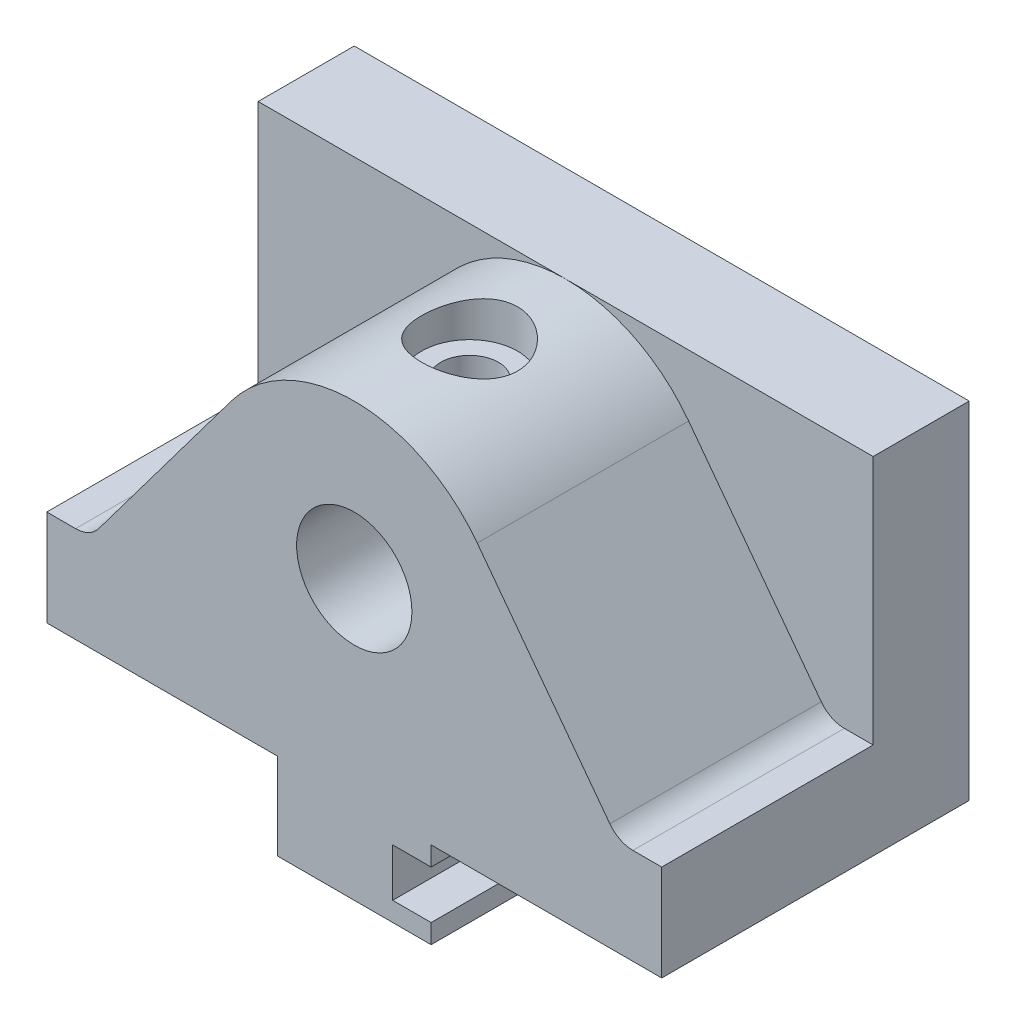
ISO-10303-21;
HEADER;
FILE_DESCRIPTION(('STEP AP214'),'2;1');
FILE_NAME('part.step','',(''),(''),'','','');
FILE_SCHEMA(('AUTOMOTIVE_DESIGN { 1 0 10303 214 1 1 1 1 }'));
ENDSEC;
DATA;
#1=APPLICATION_CONTEXT('core data for automotive mechanical design processes');
#2=APPLICATION_PROTOCOL_DEFINITION('international standard','automotive_design',2000,#1);
#3=PRODUCT_CONTEXT('',#1,'mechanical');
#4=PRODUCT('Part','Part','',(#3));
#5=PRODUCT_RELATED_PRODUCT_CATEGORY('part','',(#4));
#6=PRODUCT_DEFINITION_FORMATION('','',#4);
#7=PRODUCT_DEFINITION_CONTEXT('part definition',#1,'design');
#8=PRODUCT_DEFINITION('design','',#6,#7);
#9=PRODUCT_DEFINITION_SHAPE('','',#8);
#10=(LENGTH_UNIT() NAMED_UNIT(*) SI_UNIT(.MILLI.,.METRE.));
#11=(NAMED_UNIT(*) PLANE_ANGLE_UNIT() SI_UNIT($,.RADIAN.));
#12=(NAMED_UNIT(*) SI_UNIT($,.STERADIAN.) SOLID_ANGLE_UNIT());
#13=UNCERTAINTY_MEASURE_WITH_UNIT(LENGTH_MEASURE(1.E-05),#10,'distance_accuracy_value','');
#14=(GEOMETRIC_REPRESENTATION_CONTEXT(3) GLOBAL_UNCERTAINTY_ASSIGNED_CONTEXT((#13)) GLOBAL_UNIT_ASSIGNED_CONTEXT((#10,
#11,#12)) REPRESENTATION_CONTEXT('',''));
#15=CARTESIAN_POINT('',(0.,0.,0.));
#16=DIRECTION('',(0.,0.,1.));
#17=DIRECTION('',(1.,0.,0.));
#18=AXIS2_PLACEMENT_3D('',#15,#16,#17);
#19=CARTESIAN_POINT('',(8.,-9.,22.));
#20=DIRECTION('',(-1.,0.,0.));
#21=DIRECTION('',(0.,-1.,0.));
#22=AXIS2_PLACEMENT_3D('',#19,#20,#21);
#23=PLANE('',#22);
#24=DIRECTION('',(0.,-1.,0.));
#25=VECTOR('',#24,1.);
#26=CARTESIAN_POINT('',(8.,0.,-10.));
#27=LINE('',#26,#25);
#28=CARTESIAN_POINT('',(8.,-6.99999999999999,-10.));
#29=VERTEX_POINT('',#28);
#30=CARTESIAN_POINT('',(8.,-9.,-10.));
#31=VERTEX_POINT('',#30);
#32=EDGE_CURVE('E208',#29,#31,#27,.T.);
#33=ORIENTED_EDGE('',*,*,#32,.F.);
#34=DIRECTION('',(0.,0.,1.));
#35=VECTOR('',#34,1.);
#36=CARTESIAN_POINT('',(8.,-6.99999999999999,-10.));
#37=LINE('',#36,#35);
#38=CARTESIAN_POINT('',(8.,-6.99999999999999,22.));
#39=VERTEX_POINT('',#38);
#40=EDGE_CURVE('E402',#29,#39,#37,.T.);
#41=ORIENTED_EDGE('',*,*,#40,.T.);
#42=DIRECTION('',(0.,1.,0.));
#43=VECTOR('',#42,1.);
#44=CARTESIAN_POINT('',(8.,-9.,22.));
#45=LINE('',#44,#43);
#46=CARTESIAN_POINT('',(8.,-9.,22.));
#47=VERTEX_POINT('',#46);
#48=EDGE_CURVE('E266',#47,#39,#45,.T.);
#49=ORIENTED_EDGE('',*,*,#48,.F.);
#50=DIRECTION('',(0.,0.,-1.));
#51=VECTOR('',#50,1.);
#52=CARTESIAN_POINT('',(8.,-9.,22.));
#53=LINE('',#52,#51);
#54=EDGE_CURVE('E395',#47,#31,#53,.T.);
#55=ORIENTED_EDGE('',*,*,#54,.T.);
#56=EDGE_LOOP('',(#33,#41,#49,#55));
#57=FACE_BOUND('',#56,.T.);
#58=ADVANCED_FACE('F31',(#57),#23,.F.);
#59=CARTESIAN_POINT('',(8.,0.,22.));
#60=DIRECTION('',(0.,1.,0.));
#61=DIRECTION('',(-1.,0.,0.));
#62=AXIS2_PLACEMENT_3D('',#59,#60,#61);
#63=PLANE('',#62);
#64=DIRECTION('',(0.,0.,-1.));
#65=VECTOR('',#64,1.);
#66=CARTESIAN_POINT('',(8.,0.,22.));
#67=LINE('',#66,#65);
#68=CARTESIAN_POINT('',(8.,0.,22.));
#69=VERTEX_POINT('',#68);
#70=CARTESIAN_POINT('',(8.,0.,-10.));
#71=VERTEX_POINT('',#70);
#72=EDGE_CURVE('E269',#69,#71,#67,.T.);
#73=ORIENTED_EDGE('',*,*,#72,.T.);
#74=DIRECTION('',(-1.,0.,0.));
#75=VECTOR('',#74,1.);
#76=CARTESIAN_POINT('',(32.,0.,-10.));
#77=LINE('',#76,#75);
#78=CARTESIAN_POINT('',(32.,0.,-10.));
#79=VERTEX_POINT('',#78);
#80=EDGE_CURVE('E206',#79,#71,#77,.T.);
#81=ORIENTED_EDGE('',*,*,#80,.F.);
#82=DIRECTION('',(0.,0.,-1.));
#83=VECTOR('',#82,1.);
#84=CARTESIAN_POINT('',(32.,0.,22.));
#85=LINE('',#84,#83);
#86=CARTESIAN_POINT('',(32.,0.,22.));
#87=VERTEX_POINT('',#86);
#88=EDGE_CURVE('E292',#87,#79,#85,.T.);
#89=ORIENTED_EDGE('',*,*,#88,.F.);
#90=DIRECTION('',(1.,0.,0.));
#91=VECTOR('',#90,1.);
#92=CARTESIAN_POINT('',(8.,0.,22.));
#93=LINE('',#92,#91);
#94=EDGE_CURVE('E241',#69,#87,#93,.T.);
#95=ORIENTED_EDGE('',*,*,#94,.F.);
#96=EDGE_LOOP('',(#73,#81,#89,#95));
#97=FACE_BOUND('',#96,.T.);
#98=ADVANCED_FACE('F485',(#97),#63,.F.);
#99=CARTESIAN_POINT('',(32.,0.,22.));
#100=DIRECTION('',(-1.,0.,0.));
#101=DIRECTION('',(0.,0.,1.));
#102=AXIS2_PLACEMENT_3D('',#99,#100,#101);
#103=PLANE('',#102);
#104=ORIENTED_EDGE('',*,*,#88,.T.);
#105=DIRECTION('',(0.,-1.,0.));
#106=VECTOR('',#105,1.);
#107=CARTESIAN_POINT('',(32.,0.,-10.));
#108=LINE('',#107,#106);
#109=CARTESIAN_POINT('',(32.,36.,-10.));
#110=VERTEX_POINT('',#109);
#111=EDGE_CURVE('E383',#110,#79,#108,.T.);
#112=ORIENTED_EDGE('',*,*,#111,.F.);
#113=DIRECTION('',(0.,0.,1.));
#114=VECTOR('',#113,1.);
#115=CARTESIAN_POINT('',(32.,36.,-10.));
#116=LINE('',#115,#114);
#117=CARTESIAN_POINT('',(32.,36.,0.));
#118=VERTEX_POINT('',#117);
#119=EDGE_CURVE('E225',#110,#118,#116,.T.);
#120=ORIENTED_EDGE('',*,*,#119,.T.);
#121=DIRECTION('',(0.,-1.,0.));
#122=VECTOR('',#121,1.);
#123=CARTESIAN_POINT('',(32.,0.,0.));
#124=LINE('',#123,#122);
#125=CARTESIAN_POINT('',(32.,10.,0.));
#126=VERTEX_POINT('',#125);
#127=EDGE_CURVE('E231',#118,#126,#124,.T.);
#128=ORIENTED_EDGE('',*,*,#127,.T.);
#129=DIRECTION('',(0.,0.,-1.));
#130=VECTOR('',#129,1.);
#131=CARTESIAN_POINT('',(32.,10.,22.));
#132=LINE('',#131,#130);
#133=CARTESIAN_POINT('',(32.,10.,22.));
#134=VERTEX_POINT('',#133);
#135=EDGE_CURVE('E325',#134,#126,#132,.T.);
#136=ORIENTED_EDGE('',*,*,#135,.F.);
#137=DIRECTION('',(0.,1.,0.));
#138=VECTOR('',#137,1.);
#139=CARTESIAN_POINT('',(32.,0.,22.));
#140=LINE('',#139,#138);
#141=EDGE_CURVE('E244',#87,#134,#140,.T.);
#142=ORIENTED_EDGE('',*,*,#141,.F.);
#143=EDGE_LOOP('',(#104,#112,#120,#128,#136,#142));
#144=FACE_BOUND('',#143,.T.);
#145=ADVANCED_FACE('F490',(#144),#103,.F.);
#146=CARTESIAN_POINT('',(32.,10.,22.));
#147=DIRECTION('',(0.,-1.,0.));
#148=DIRECTION('',(1.,0.,0.));
#149=AXIS2_PLACEMENT_3D('',#146,#147,#148);
#150=PLANE('',#149);
#151=DIRECTION('',(-1.,0.,0.));
#152=VECTOR('',#151,1.);
#153=CARTESIAN_POINT('',(32.,10.,0.));
#154=LINE('',#153,#152);
#155=CARTESIAN_POINT('',(29.,10.,0.));
#156=VERTEX_POINT('',#155);
#157=EDGE_CURVE('E273',#126,#156,#154,.T.);
#158=ORIENTED_EDGE('',*,*,#157,.T.);
#159=DIRECTION('',(0.,0.,-1.));
#160=VECTOR('',#159,1.);
#161=CARTESIAN_POINT('',(29.,10.,22.));
#162=LINE('',#161,#160);
#163=CARTESIAN_POINT('',(29.,10.,22.));
#164=VERTEX_POINT('',#163);
#165=EDGE_CURVE('E58',#156,#164,#162,.F.);
#166=ORIENTED_EDGE('',*,*,#165,.T.);
#167=DIRECTION('',(-1.,0.,0.));
#168=VECTOR('',#167,1.);
#169=CARTESIAN_POINT('',(32.,10.,22.));
#170=LINE('',#169,#168);
#171=EDGE_CURVE('E247',#134,#164,#170,.T.);
#172=ORIENTED_EDGE('',*,*,#171,.F.);
#173=ORIENTED_EDGE('',*,*,#135,.T.);
#174=EDGE_LOOP('',(#158,#166,#172,#173));
#175=FACE_BOUND('',#174,.T.);
#176=ADVANCED_FACE('F323',(#175),#150,.F.);
#177=CARTESIAN_POINT('',(27.5,10.,22.));
#178=DIRECTION('',(-0.8,-0.6,0.));
#179=DIRECTION('',(0.6,-0.8,0.));
#180=AXIS2_PLACEMENT_3D('',#177,#178,#179);
#181=PLANE('',#180);
#182=DIRECTION('',(-0.6,0.8,0.));
#183=VECTOR('',#182,1.);
#184=CARTESIAN_POINT('',(27.5,10.,22.));
#185=LINE('',#184,#183);
#186=CARTESIAN_POINT('',(26.6,11.2,22.));
#187=VERTEX_POINT('',#186);
#188=CARTESIAN_POINT('',(12.8,29.6,22.));
#189=VERTEX_POINT('',#188);
#190=EDGE_CURVE('E249',#187,#189,#185,.T.);
#191=ORIENTED_EDGE('',*,*,#190,.F.);
#192=DIRECTION('',(0.,0.,-1.));
#193=VECTOR('',#192,1.);
#194=CARTESIAN_POINT('',(26.6,11.2,0.));
#195=LINE('',#194,#193);
#196=CARTESIAN_POINT('',(26.6,11.2,0.));
#197=VERTEX_POINT('',#196);
#198=EDGE_CURVE('E296',#187,#197,#195,.T.);
#199=ORIENTED_EDGE('',*,*,#198,.T.);
#200=DIRECTION('',(-0.6,0.8,0.));
#201=VECTOR('',#200,1.);
#202=CARTESIAN_POINT('',(27.5,10.,0.));
#203=LINE('',#202,#201);
#204=CARTESIAN_POINT('',(12.8,29.6,0.));
#205=VERTEX_POINT('',#204);
#206=EDGE_CURVE('E270',#197,#205,#203,.T.);
#207=ORIENTED_EDGE('',*,*,#206,.T.);
#208=DIRECTION('',(0.,0.,-1.));
#209=VECTOR('',#208,1.);
#210=CARTESIAN_POINT('',(12.8,29.6,22.));
#211=LINE('',#210,#209);
#212=EDGE_CURVE('E316',#189,#205,#211,.T.);
#213=ORIENTED_EDGE('',*,*,#212,.F.);
#214=EDGE_LOOP('',(#191,#199,#207,#213));
#215=FACE_BOUND('',#214,.T.);
#216=ADVANCED_FACE('F313',(#215),#181,.F.);
#217=CARTESIAN_POINT('',(0.,20.,22.));
#218=DIRECTION('',(0.,0.,-1.));
#219=DIRECTION('',(-1.,0.,0.));
#220=AXIS2_PLACEMENT_3D('',#217,#218,#219);
#221=CYLINDRICAL_SURFACE('',#220,16.);
#222=CARTESIAN_POINT('',(0.,36.,15.));
#223=CARTESIAN_POINT('',(-0.273756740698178,35.9999986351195,14.9999982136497));
#224=CARTESIAN_POINT('',(-0.547532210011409,35.9929077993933,14.9774430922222));
#225=CARTESIAN_POINT('',(-1.08707683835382,35.9653157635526,14.888055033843));
#226=CARTESIAN_POINT('',(-1.35284417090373,35.9448115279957,14.8212120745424));
#227=CARTESIAN_POINT('',(-1.86851417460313,35.892632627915,14.6457225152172));
#228=CARTESIAN_POINT('',(-2.11844070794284,35.860975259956,14.5371406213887));
#229=CARTESIAN_POINT('',(-2.59653920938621,35.7897587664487,14.2815307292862));
#230=CARTESIAN_POINT('',(-2.82470774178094,35.7501983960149,14.1344966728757));
#231=CARTESIAN_POINT('',(-3.25986133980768,35.6660085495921,13.8013760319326));
#232=CARTESIAN_POINT('',(-3.46608011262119,35.621268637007,13.6143164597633));
#233=CARTESIAN_POINT('',(-3.84478952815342,35.5324018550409,13.2085264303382));
#234=CARTESIAN_POINT('',(-4.01727389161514,35.4882751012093,12.9897900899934));
#235=CARTESIAN_POINT('',(-4.32777345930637,35.4044457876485,12.5202217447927));
#236=CARTESIAN_POINT('',(-4.4648313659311,35.3648795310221,12.2687300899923));
#237=CARTESIAN_POINT('',(-4.69438964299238,35.2963120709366,11.7448307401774));
#238=CARTESIAN_POINT('',(-4.78690175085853,35.2673080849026,11.4724285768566));
#239=CARTESIAN_POINT('',(-4.92193839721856,35.224304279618,10.9230876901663));
#240=CARTESIAN_POINT('',(-4.96588440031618,35.2098789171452,10.6465326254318));
#241=CARTESIAN_POINT('',(-5.00698220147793,35.1964022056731,10.0896275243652));
#242=CARTESIAN_POINT('',(-5.00414643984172,35.1973467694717,9.80927851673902));
#243=CARTESIAN_POINT('',(-4.95287298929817,35.2141275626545,9.26450215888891));
#244=CARTESIAN_POINT('',(-4.90624231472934,35.229373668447,8.99988349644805));
#245=CARTESIAN_POINT('',(-4.77163253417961,35.272081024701,8.48243137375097));
#246=CARTESIAN_POINT('',(-4.68364903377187,35.2995435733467,8.2295991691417));
#247=CARTESIAN_POINT('',(-4.46755498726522,35.3640417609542,7.73859222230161));
#248=CARTESIAN_POINT('',(-4.33887702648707,35.4012113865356,7.5006855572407));
#249=CARTESIAN_POINT('',(-4.04544082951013,35.4808742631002,7.04924892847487));
#250=CARTESIAN_POINT('',(-3.88067322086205,35.523368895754,6.83572531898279));
#251=CARTESIAN_POINT('',(-3.51086781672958,35.6112611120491,6.42890022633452));
#252=CARTESIAN_POINT('',(-3.30433828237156,35.6567027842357,6.23696176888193));
#253=CARTESIAN_POINT('',(-2.86145763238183,35.7436628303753,5.89011242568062));
#254=CARTESIAN_POINT('',(-2.625104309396,35.7851809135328,5.73520428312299));
#255=CARTESIAN_POINT('',(-2.1266584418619,35.8600517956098,5.46588924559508));
#256=CARTESIAN_POINT('',(-1.86437962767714,35.8933384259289,5.35180745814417));
#257=CARTESIAN_POINT('',(-1.32307191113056,35.9475182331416,5.16978799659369));
#258=CARTESIAN_POINT('',(-1.04404812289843,35.9684151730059,5.10183631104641));
#259=CARTESIAN_POINT('',(-0.488740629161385,35.9948555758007,5.01632782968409));
#260=CARTESIAN_POINT('',(-0.212767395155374,36.0009609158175,4.9969258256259));
#261=CARTESIAN_POINT('',(0.338521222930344,35.9987919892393,5.00386490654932));
#262=CARTESIAN_POINT('',(0.613836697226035,35.9905198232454,5.03019930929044));
#263=CARTESIAN_POINT('',(1.1488773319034,35.9608945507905,5.12638237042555));
#264=CARTESIAN_POINT('',(1.40881991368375,35.9398717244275,5.19513307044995));
#265=CARTESIAN_POINT('',(1.91340771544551,35.8872048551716,5.37285740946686));
#266=CARTESIAN_POINT('',(2.15805104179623,35.8555595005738,5.48183601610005));
#267=CARTESIAN_POINT('',(2.63172962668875,35.783941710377,5.73989286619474));
#268=CARTESIAN_POINT('',(2.86023895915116,35.7437850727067,5.88988394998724));
#269=CARTESIAN_POINT('',(3.28946340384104,35.6597364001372,6.2246128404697));
#270=CARTESIAN_POINT('',(3.4901709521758,35.6158433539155,6.40936007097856));
#271=CARTESIAN_POINT('',(3.86634985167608,35.5270797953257,6.81703556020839));
#272=CARTESIAN_POINT('',(4.04050609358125,35.4822394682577,7.04118665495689));
#273=CARTESIAN_POINT('',(4.34885000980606,35.3984778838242,7.5165064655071));
#274=CARTESIAN_POINT('',(4.48303831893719,35.3595565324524,7.76767475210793));
#275=CARTESIAN_POINT('',(4.70680333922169,35.2924712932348,8.28938069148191));
#276=CARTESIAN_POINT('',(4.7965527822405,35.264265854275,8.55983859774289));
#277=CARTESIAN_POINT('',(4.92891577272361,35.2220468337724,9.11308997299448));
#278=CARTESIAN_POINT('',(4.97154725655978,35.2080278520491,9.39587870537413));
#279=CARTESIAN_POINT('',(5.00717624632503,35.1963317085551,9.95201635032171));
#280=CARTESIAN_POINT('',(5.00233118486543,35.1979441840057,10.2252138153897));
#281=CARTESIAN_POINT('',(4.94835272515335,35.2156036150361,10.7666983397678));
#282=CARTESIAN_POINT('',(4.89922139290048,35.2316498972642,11.0349856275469));
#283=CARTESIAN_POINT('',(4.7595091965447,35.2758725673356,11.5551761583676));
#284=CARTESIAN_POINT('',(4.66954569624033,35.3038679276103,11.8072617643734));
#285=CARTESIAN_POINT('',(4.45120909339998,35.3687881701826,12.292961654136));
#286=CARTESIAN_POINT('',(4.32282817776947,35.4057148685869,12.5265721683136));
#287=CARTESIAN_POINT('',(4.02542700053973,35.4861394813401,12.9785838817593));
#288=CARTESIAN_POINT('',(3.85501334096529,35.5298379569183,13.196032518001));
#289=CARTESIAN_POINT('',(3.48083598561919,35.6179599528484,13.599945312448));
#290=CARTESIAN_POINT('',(3.27706336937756,35.6623836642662,13.7864011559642));
#291=CARTESIAN_POINT('',(2.83394665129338,35.748690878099,14.1291301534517));
#292=CARTESIAN_POINT('',(2.59365829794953,35.7904440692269,14.2842189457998));
#293=CARTESIAN_POINT('',(2.0891165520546,35.8650707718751,14.5515956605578));
#294=CARTESIAN_POINT('',(1.82487263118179,35.8979477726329,14.6639004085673));
#295=CARTESIAN_POINT('',(1.30299054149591,35.9488260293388,14.8343654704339));
#296=CARTESIAN_POINT('',(1.04668134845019,35.9678496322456,14.8962994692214));
#297=CARTESIAN_POINT('',(0.526919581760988,35.9934360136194,14.9791134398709));
#298=CARTESIAN_POINT('',(0.263468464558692,36.0000013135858,15.000001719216));
#299=CARTESIAN_POINT('',(0.,36.,15.));
#300=B_SPLINE_CURVE_WITH_KNOTS('',3,(#222,#223,#224,#225,#226,#227,#228,#229,#230,#231,#232,
#233,#234,#235,#236,#237,#238,#239,#240,#241,#242,#243,#244,#245,#246,#247,#248,#249,#250,#251,
#252,#253,#254,#255,#256,#257,#258,#259,#260,#261,#262,#263,#264,#265,#266,#267,#268,#269,#270,
#271,#272,#273,#274,#275,#276,#277,#278,#279,#280,#281,#282,#283,#284,#285,#286,#287,#288,#289,
#290,#291,#292,#293,#294,#295,#296,#297,#298,#299),.UNSPECIFIED.,.T.,.F.,(4,2,2,2,2,2,2,2,2,2,2,
2,2,2,2,2,2,2,2,2,2,2,2,2,2,2,2,2,2,2,2,2,2,2,2,2,2,2,4),(0.,0.820301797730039,1.64078929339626,
2.46000991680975,3.27935968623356,4.12151288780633,4.96382269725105,5.82695084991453,
6.68985145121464,7.52676600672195,8.36345801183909,9.16707669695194,9.97078079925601,
10.7862257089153,11.6018826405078,12.4546698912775,13.3075202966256,14.1670184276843,
15.0262553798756,15.852302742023,16.678229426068,17.4836250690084,18.2891202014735,
19.1142529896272,19.9396098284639,20.7976711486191,21.655718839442,22.5104046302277,
23.3647649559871,24.1804881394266,24.9961732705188,25.7999165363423,26.6038233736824,
27.4391805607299,28.274761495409,29.1376267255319,30.0001522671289,30.789785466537,
31.5792588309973),.UNSPECIFIED.);
#301=CARTESIAN_POINT('',(0.,36.,15.));
#302=VERTEX_POINT('',#301);
#303=EDGE_CURVE('E11',#302,#302,#300,.T.);
#304=ORIENTED_EDGE('',*,*,#303,.T.);
#305=EDGE_LOOP('',(#304));
#306=FACE_BOUND('',#305,.T.);
#307=CARTESIAN_POINT('',(0.,20.,0.));
#308=DIRECTION('',(0.,0.,1.));
#309=DIRECTION('',(1.,0.,0.));
#310=AXIS2_PLACEMENT_3D('',#307,#308,#309);
#311=CIRCLE('',#310,16.);
#312=CARTESIAN_POINT('',(0.,36.,0.));
#313=VERTEX_POINT('',#312);
#314=EDGE_CURVE('E274',#205,#313,#311,.T.);
#315=ORIENTED_EDGE('',*,*,#314,.T.);
#316=CARTESIAN_POINT('',(-12.8,29.6,0.));
#317=VERTEX_POINT('',#316);
#318=EDGE_CURVE('E272',#313,#317,#311,.T.);
#319=ORIENTED_EDGE('',*,*,#318,.T.);
#320=DIRECTION('',(0.,0.,-1.));
#321=VECTOR('',#320,1.);
#322=CARTESIAN_POINT('',(-12.8,29.6,22.));
#323=LINE('',#322,#321);
#324=CARTESIAN_POINT('',(-12.8,29.6,22.));
#325=VERTEX_POINT('',#324);
#326=EDGE_CURVE('E337',#325,#317,#323,.T.);
#327=ORIENTED_EDGE('',*,*,#326,.F.);
#328=CARTESIAN_POINT('',(0.,20.,22.));
#329=DIRECTION('',(0.,0.,1.));
#330=DIRECTION('',(1.,0.,0.));
#331=AXIS2_PLACEMENT_3D('',#328,#329,#330);
#332=CIRCLE('',#331,16.);
#333=EDGE_CURVE('E251',#189,#325,#332,.T.);
#334=ORIENTED_EDGE('',*,*,#333,.F.);
#335=ORIENTED_EDGE('',*,*,#212,.T.);
#336=EDGE_LOOP('',(#315,#319,#327,#334,#335));
#337=FACE_BOUND('',#336,.T.);
#338=ADVANCED_FACE('F354',(#306,#337),#221,.T.);
#339=CARTESIAN_POINT('',(-12.8,29.6,22.));
#340=DIRECTION('',(0.799999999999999,-0.600000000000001,0.));
#341=DIRECTION('',(0.600000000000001,0.799999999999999,0.));
#342=AXIS2_PLACEMENT_3D('',#339,#340,#341);
#343=PLANE('',#342);
#344=DIRECTION('',(-0.600000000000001,-0.799999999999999,0.));
#345=VECTOR('',#344,1.);
#346=CARTESIAN_POINT('',(-12.8,29.6,0.));
#347=LINE('',#346,#345);
#348=CARTESIAN_POINT('',(-26.6,11.2,0.));
#349=VERTEX_POINT('',#348);
#350=EDGE_CURVE('E277',#317,#349,#347,.T.);
#351=ORIENTED_EDGE('',*,*,#350,.T.);
#352=DIRECTION('',(0.,0.,-1.));
#353=VECTOR('',#352,1.);
#354=CARTESIAN_POINT('',(-26.6,11.2,22.));
#355=LINE('',#354,#353);
#356=CARTESIAN_POINT('',(-26.6,11.2,22.));
#357=VERTEX_POINT('',#356);
#358=EDGE_CURVE('E294',#349,#357,#355,.F.);
#359=ORIENTED_EDGE('',*,*,#358,.T.);
#360=DIRECTION('',(-0.600000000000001,-0.799999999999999,0.));
#361=VECTOR('',#360,1.);
#362=CARTESIAN_POINT('',(-12.8,29.6,22.));
#363=LINE('',#362,#361);
#364=EDGE_CURVE('E253',#325,#357,#363,.T.);
#365=ORIENTED_EDGE('',*,*,#364,.F.);
#366=ORIENTED_EDGE('',*,*,#326,.T.);
#367=EDGE_LOOP('',(#351,#359,#365,#366));
#368=FACE_BOUND('',#367,.T.);
#369=ADVANCED_FACE('F514',(#368),#343,.F.);
#370=CARTESIAN_POINT('',(-27.5,10.,22.));
#371=DIRECTION('',(0.,-1.,0.));
#372=DIRECTION('',(0.,0.,-1.));
#373=AXIS2_PLACEMENT_3D('',#370,#371,#372);
#374=PLANE('',#373);
#375=DIRECTION('',(-1.,0.,0.));
#376=VECTOR('',#375,1.);
#377=CARTESIAN_POINT('',(-27.5,10.,22.));
#378=LINE('',#377,#376);
#379=CARTESIAN_POINT('',(-29.,10.,22.));
#380=VERTEX_POINT('',#379);
#381=CARTESIAN_POINT('',(-32.,10.,22.));
#382=VERTEX_POINT('',#381);
#383=EDGE_CURVE('E256',#380,#382,#378,.T.);
#384=ORIENTED_EDGE('',*,*,#383,.F.);
#385=DIRECTION('',(0.,0.,-1.));
#386=VECTOR('',#385,1.);
#387=CARTESIAN_POINT('',(-29.,10.,0.));
#388=LINE('',#387,#386);
#389=CARTESIAN_POINT('',(-29.,10.,0.));
#390=VERTEX_POINT('',#389);
#391=EDGE_CURVE('E288',#380,#390,#388,.T.);
#392=ORIENTED_EDGE('',*,*,#391,.T.);
#393=DIRECTION('',(-1.,0.,0.));
#394=VECTOR('',#393,1.);
#395=CARTESIAN_POINT('',(-27.5,10.,0.));
#396=LINE('',#395,#394);
#397=CARTESIAN_POINT('',(-32.,10.,0.));
#398=VERTEX_POINT('',#397);
#399=EDGE_CURVE('E245',#390,#398,#396,.T.);
#400=ORIENTED_EDGE('',*,*,#399,.T.);
#401=DIRECTION('',(0.,0.,-1.));
#402=VECTOR('',#401,1.);
#403=CARTESIAN_POINT('',(-32.,10.,22.));
#404=LINE('',#403,#402);
#405=EDGE_CURVE('E335',#382,#398,#404,.T.);
#406=ORIENTED_EDGE('',*,*,#405,.F.);
#407=EDGE_LOOP('',(#384,#392,#400,#406));
#408=FACE_BOUND('',#407,.T.);
#409=ADVANCED_FACE('F367',(#408),#374,.F.);
#410=CARTESIAN_POINT('',(-32.,10.,22.));
#411=DIRECTION('',(1.,0.,0.));
#412=DIRECTION('',(0.,1.,0.));
#413=AXIS2_PLACEMENT_3D('',#410,#411,#412);
#414=PLANE('',#413);
#415=ORIENTED_EDGE('',*,*,#405,.T.);
#416=DIRECTION('',(0.,1.,0.));
#417=VECTOR('',#416,1.);
#418=CARTESIAN_POINT('',(-32.,0.,0.));
#419=LINE('',#418,#417);
#420=CARTESIAN_POINT('',(-32.,36.,0.));
#421=VERTEX_POINT('',#420);
#422=EDGE_CURVE('E235',#398,#421,#419,.T.);
#423=ORIENTED_EDGE('',*,*,#422,.T.);
#424=DIRECTION('',(0.,0.,1.));
#425=VECTOR('',#424,1.);
#426=CARTESIAN_POINT('',(-32.,36.,-10.));
#427=LINE('',#426,#425);
#428=CARTESIAN_POINT('',(-32.,36.,-10.));
#429=VERTEX_POINT('',#428);
#430=EDGE_CURVE('E237',#429,#421,#427,.T.);
#431=ORIENTED_EDGE('',*,*,#430,.F.);
#432=DIRECTION('',(0.,1.,0.));
#433=VECTOR('',#432,1.);
#434=CARTESIAN_POINT('',(-32.,0.,-10.));
#435=LINE('',#434,#433);
#436=CARTESIAN_POINT('',(-32.,0.,-10.));
#437=VERTEX_POINT('',#436);
#438=EDGE_CURVE('E221',#437,#429,#435,.T.);
#439=ORIENTED_EDGE('',*,*,#438,.F.);
#440=DIRECTION('',(0.,0.,-1.));
#441=VECTOR('',#440,1.);
#442=CARTESIAN_POINT('',(-32.,0.,22.));
#443=LINE('',#442,#441);
#444=CARTESIAN_POINT('',(-32.,0.,22.));
#445=VERTEX_POINT('',#444);
#446=EDGE_CURVE('E338',#445,#437,#443,.T.);
#447=ORIENTED_EDGE('',*,*,#446,.F.);
#448=DIRECTION('',(0.,-1.,0.));
#449=VECTOR('',#448,1.);
#450=CARTESIAN_POINT('',(-32.,10.,22.));
#451=LINE('',#450,#449);
#452=EDGE_CURVE('E258',#382,#445,#451,.T.);
#453=ORIENTED_EDGE('',*,*,#452,.F.);
#454=EDGE_LOOP('',(#415,#423,#431,#439,#447,#453));
#455=FACE_BOUND('',#454,.T.);
#456=ADVANCED_FACE('F375',(#455),#414,.F.);
#457=CARTESIAN_POINT('',(-32.,0.,22.));
#458=DIRECTION('',(0.,1.,0.));
#459=DIRECTION('',(-1.,0.,0.));
#460=AXIS2_PLACEMENT_3D('',#457,#458,#459);
#461=PLANE('',#460);
#462=ORIENTED_EDGE('',*,*,#446,.T.);
#463=DIRECTION('',(-1.,0.,0.));
#464=VECTOR('',#463,1.);
#465=CARTESIAN_POINT('',(-8.,0.,-10.));
#466=LINE('',#465,#464);
#467=CARTESIAN_POINT('',(-8.,0.,-10.));
#468=VERTEX_POINT('',#467);
#469=EDGE_CURVE('E218',#468,#437,#466,.T.);
#470=ORIENTED_EDGE('',*,*,#469,.F.);
#471=DIRECTION('',(0.,0.,-1.));
#472=VECTOR('',#471,1.);
#473=CARTESIAN_POINT('',(-8.,0.,22.));
#474=LINE('',#473,#472);
#475=CARTESIAN_POINT('',(-8.,0.,22.));
#476=VERTEX_POINT('',#475);
#477=EDGE_CURVE('E344',#476,#468,#474,.T.);
#478=ORIENTED_EDGE('',*,*,#477,.F.);
#479=DIRECTION('',(1.,0.,0.));
#480=VECTOR('',#479,1.);
#481=CARTESIAN_POINT('',(-32.,0.,22.));
#482=LINE('',#481,#480);
#483=EDGE_CURVE('E260',#445,#476,#482,.T.);
#484=ORIENTED_EDGE('',*,*,#483,.F.);
#485=EDGE_LOOP('',(#462,#470,#478,#484));
#486=FACE_BOUND('',#485,.T.);
#487=ADVANCED_FACE('F385',(#486),#461,.F.);
#488=CARTESIAN_POINT('',(-8.,0.,22.));
#489=DIRECTION('',(1.,0.,0.));
#490=DIRECTION('',(0.,1.,0.));
#491=AXIS2_PLACEMENT_3D('',#488,#489,#490);
#492=PLANE('',#491);
#493=ORIENTED_EDGE('',*,*,#477,.T.);
#494=DIRECTION('',(0.,1.,0.));
#495=VECTOR('',#494,1.);
#496=CARTESIAN_POINT('',(-8.,-9.00000000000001,-10.));
#497=LINE('',#496,#495);
#498=CARTESIAN_POINT('',(-8.,-9.00000000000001,-10.));
#499=VERTEX_POINT('',#498);
#500=EDGE_CURVE('E211',#499,#468,#497,.T.);
#501=ORIENTED_EDGE('',*,*,#500,.F.);
#502=DIRECTION('',(0.,0.,-1.));
#503=VECTOR('',#502,1.);
#504=CARTESIAN_POINT('',(-8.,-9.00000000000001,22.));
#505=LINE('',#504,#503);
#506=CARTESIAN_POINT('',(-8.,-9.00000000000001,22.));
#507=VERTEX_POINT('',#506);
#508=EDGE_CURVE('E350',#507,#499,#505,.T.);
#509=ORIENTED_EDGE('',*,*,#508,.F.);
#510=DIRECTION('',(0.,-1.,0.));
#511=VECTOR('',#510,1.);
#512=CARTESIAN_POINT('',(-8.,0.,22.));
#513=LINE('',#512,#511);
#514=EDGE_CURVE('E262',#476,#507,#513,.T.);
#515=ORIENTED_EDGE('',*,*,#514,.F.);
#516=EDGE_LOOP('',(#493,#501,#509,#515));
#517=FACE_BOUND('',#516,.T.);
#518=ADVANCED_FACE('F392',(#517),#492,.F.);
#519=CARTESIAN_POINT('',(-8.,-9.00000000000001,22.));
#520=DIRECTION('',(0.,1.,0.));
#521=DIRECTION('',(-1.,0.,0.));
#522=AXIS2_PLACEMENT_3D('',#519,#520,#521);
#523=PLANE('',#522);
#524=CARTESIAN_POINT('',(0.,-9.,14.));
#525=DIRECTION('',(0.,-1.,0.));
#526=DIRECTION('',(0.,0.,-1.));
#527=AXIS2_PLACEMENT_3D('',#524,#525,#526);
#528=CIRCLE('',#527,3.);
#529=CARTESIAN_POINT('',(0.,-9.,11.));
#530=VERTEX_POINT('',#529);
#531=EDGE_CURVE('E413',#530,#530,#528,.T.);
#532=ORIENTED_EDGE('',*,*,#531,.F.);
#533=EDGE_LOOP('',(#532));
#534=FACE_BOUND('',#533,.T.);
#535=CARTESIAN_POINT('',(0.,-9.,-2.));
#536=DIRECTION('',(0.,-1.,0.));
#537=DIRECTION('',(0.,0.,-1.));
#538=AXIS2_PLACEMENT_3D('',#535,#536,#537);
#539=CIRCLE('',#538,3.);
#540=CARTESIAN_POINT('',(0.,-9.,-5.));
#541=VERTEX_POINT('',#540);
#542=EDGE_CURVE('E422',#541,#541,#539,.T.);
#543=ORIENTED_EDGE('',*,*,#542,.F.);
#544=EDGE_LOOP('',(#543));
#545=FACE_BOUND('',#544,.T.);
#546=ORIENTED_EDGE('',*,*,#508,.T.);
#547=DIRECTION('',(-1.,0.,0.));
#548=VECTOR('',#547,1.);
#549=CARTESIAN_POINT('',(8.,-9.,-10.));
#550=LINE('',#549,#548);
#551=EDGE_CURVE('E207',#31,#499,#550,.T.);
#552=ORIENTED_EDGE('',*,*,#551,.F.);
#553=ORIENTED_EDGE('',*,*,#54,.F.);
#554=DIRECTION('',(1.,0.,0.));
#555=VECTOR('',#554,1.);
#556=CARTESIAN_POINT('',(-8.,-9.00000000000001,22.));
#557=LINE('',#556,#555);
#558=EDGE_CURVE('E264',#507,#47,#557,.T.);
#559=ORIENTED_EDGE('',*,*,#558,.F.);
#560=EDGE_LOOP('',(#546,#552,#553,#559));
#561=FACE_BOUND('',#560,.T.);
#562=ADVANCED_FACE('F396',(#534,#545,#561),#523,.F.);
#563=CARTESIAN_POINT('',(8.,-1.99999999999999,22.));
#564=VERTEX_POINT('',#563);
#565=EDGE_CURVE('E199',#564,#69,#45,.T.);
#566=ORIENTED_EDGE('',*,*,#565,.F.);
#567=DIRECTION('',(0.,0.,1.));
#568=VECTOR('',#567,1.);
#569=CARTESIAN_POINT('',(8.,-1.99999999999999,-10.));
#570=LINE('',#569,#568);
#571=CARTESIAN_POINT('',(8.,-1.99999999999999,-10.));
#572=VERTEX_POINT('',#571);
#573=EDGE_CURVE('E186',#572,#564,#570,.T.);
#574=ORIENTED_EDGE('',*,*,#573,.F.);
#575=EDGE_CURVE('E198',#71,#572,#27,.T.);
#576=ORIENTED_EDGE('',*,*,#575,.F.);
#577=ORIENTED_EDGE('',*,*,#72,.F.);
#578=EDGE_LOOP('',(#566,#574,#576,#577));
#579=FACE_BOUND('',#578,.T.);
#580=ADVANCED_FACE('F196',(#579),#23,.F.);
#581=CARTESIAN_POINT('',(0.,20.,22.));
#582=DIRECTION('',(0.,0.,1.));
#583=DIRECTION('',(1.,0.,0.));
#584=AXIS2_PLACEMENT_3D('',#581,#582,#583);
#585=PLANE('',#584);
#586=DIRECTION('',(1.,0.,0.));
#587=VECTOR('',#586,1.);
#588=CARTESIAN_POINT('',(8.,-6.99999999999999,22.));
#589=LINE('',#588,#587);
#590=CARTESIAN_POINT('',(4.,-7.,22.));
#591=VERTEX_POINT('',#590);
#592=EDGE_CURVE('E191',#591,#39,#589,.T.);
#593=ORIENTED_EDGE('',*,*,#592,.F.);
#594=DIRECTION('',(0.,-1.,0.));
#595=VECTOR('',#594,1.);
#596=CARTESIAN_POINT('',(4.,-1.99999999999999,22.));
#597=LINE('',#596,#595);
#598=CARTESIAN_POINT('',(4.,-1.99999999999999,22.));
#599=VERTEX_POINT('',#598);
#600=EDGE_CURVE('E405',#599,#591,#597,.T.);
#601=ORIENTED_EDGE('',*,*,#600,.F.);
#602=DIRECTION('',(-1.,0.,0.));
#603=VECTOR('',#602,1.);
#604=CARTESIAN_POINT('',(8.,-1.99999999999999,22.));
#605=LINE('',#604,#603);
#606=EDGE_CURVE('E408',#564,#599,#605,.T.);
#607=ORIENTED_EDGE('',*,*,#606,.F.);
#608=ORIENTED_EDGE('',*,*,#565,.T.);
#609=ORIENTED_EDGE('',*,*,#94,.T.);
#610=ORIENTED_EDGE('',*,*,#141,.T.);
#611=ORIENTED_EDGE('',*,*,#171,.T.);
#612=CARTESIAN_POINT('',(29.,13.,22.));
#613=DIRECTION('',(0.,0.,1.));
#614=DIRECTION('',(1.,0.,0.));
#615=AXIS2_PLACEMENT_3D('',#612,#613,#614);
#616=CIRCLE('',#615,3.);
#617=EDGE_CURVE('E43',#164,#187,#616,.F.);
#618=ORIENTED_EDGE('',*,*,#617,.T.);
#619=ORIENTED_EDGE('',*,*,#190,.T.);
#620=ORIENTED_EDGE('',*,*,#333,.T.);
#621=ORIENTED_EDGE('',*,*,#364,.T.);
#622=CARTESIAN_POINT('',(-29.,13.,22.));
#623=DIRECTION('',(0.,0.,1.));
#624=DIRECTION('',(1.,0.,0.));
#625=AXIS2_PLACEMENT_3D('',#622,#623,#624);
#626=CIRCLE('',#625,3.);
#627=EDGE_CURVE('E302',#357,#380,#626,.F.);
#628=ORIENTED_EDGE('',*,*,#627,.T.);
#629=ORIENTED_EDGE('',*,*,#383,.T.);
#630=ORIENTED_EDGE('',*,*,#452,.T.);
#631=ORIENTED_EDGE('',*,*,#483,.T.);
#632=ORIENTED_EDGE('',*,*,#514,.T.);
#633=ORIENTED_EDGE('',*,*,#558,.T.);
#634=ORIENTED_EDGE('',*,*,#48,.T.);
#635=EDGE_LOOP('',(#593,#601,#607,#608,#609,#610,#611,#618,#619,#620,#621,#628,#629,#630,#631,
#632,#633,#634));
#636=FACE_BOUND('',#635,.T.);
#637=CARTESIAN_POINT('',(0.,20.,22.));
#638=DIRECTION('',(0.,0.,1.));
#639=DIRECTION('',(1.,0.,0.));
#640=AXIS2_PLACEMENT_3D('',#637,#638,#639);
#641=CIRCLE('',#640,6.);
#642=CARTESIAN_POINT('',(6.,20.,22.));
#643=VERTEX_POINT('',#642);
#644=EDGE_CURVE('E441',#643,#643,#641,.T.);
#645=ORIENTED_EDGE('',*,*,#644,.F.);
#646=EDGE_LOOP('',(#645));
#647=FACE_BOUND('',#646,.T.);
#648=ADVANCED_FACE('F307',(#636,#647),#585,.T.);
#649=CARTESIAN_POINT('',(32.,36.,0.));
#650=DIRECTION('',(0.,0.,1.));
#651=DIRECTION('',(1.,0.,0.));
#652=AXIS2_PLACEMENT_3D('',#649,#650,#651);
#653=PLANE('',#652);
#654=ORIENTED_EDGE('',*,*,#399,.F.);
#655=CARTESIAN_POINT('',(-29.,13.,0.));
#656=DIRECTION('',(0.,0.,1.));
#657=DIRECTION('',(1.,0.,0.));
#658=AXIS2_PLACEMENT_3D('',#655,#656,#657);
#659=CIRCLE('',#658,3.);
#660=EDGE_CURVE('E291',#390,#349,#659,.T.);
#661=ORIENTED_EDGE('',*,*,#660,.T.);
#662=ORIENTED_EDGE('',*,*,#350,.F.);
#663=ORIENTED_EDGE('',*,*,#318,.F.);
#664=DIRECTION('',(1.,0.,0.));
#665=VECTOR('',#664,1.);
#666=CARTESIAN_POINT('',(32.,36.,0.));
#667=LINE('',#666,#665);
#668=EDGE_CURVE('E373',#421,#313,#667,.T.);
#669=ORIENTED_EDGE('',*,*,#668,.F.);
#670=ORIENTED_EDGE('',*,*,#422,.F.);
#671=EDGE_LOOP('',(#654,#661,#662,#663,#669,#670));
#672=FACE_BOUND('',#671,.T.);
#673=ADVANCED_FACE('F370',(#672),#653,.T.);
#674=ORIENTED_EDGE('',*,*,#206,.F.);
#675=CARTESIAN_POINT('',(29.,13.,0.));
#676=DIRECTION('',(0.,0.,1.));
#677=DIRECTION('',(1.,0.,0.));
#678=AXIS2_PLACEMENT_3D('',#675,#676,#677);
#679=CIRCLE('',#678,3.);
#680=EDGE_CURVE('E299',#197,#156,#679,.T.);
#681=ORIENTED_EDGE('',*,*,#680,.T.);
#682=ORIENTED_EDGE('',*,*,#157,.F.);
#683=ORIENTED_EDGE('',*,*,#127,.F.);
#684=EDGE_CURVE('E240',#313,#118,#667,.T.);
#685=ORIENTED_EDGE('',*,*,#684,.F.);
#686=ORIENTED_EDGE('',*,*,#314,.F.);
#687=EDGE_LOOP('',(#674,#681,#682,#683,#685,#686));
#688=FACE_BOUND('',#687,.T.);
#689=ADVANCED_FACE('F319',(#688),#653,.T.);
#690=CARTESIAN_POINT('',(32.,36.,-10.));
#691=DIRECTION('',(0.,-1.,0.));
#692=DIRECTION('',(0.,0.,-1.));
#693=AXIS2_PLACEMENT_3D('',#690,#691,#692);
#694=PLANE('',#693);
#695=ORIENTED_EDGE('',*,*,#668,.T.);
#696=ORIENTED_EDGE('',*,*,#684,.T.);
#697=ORIENTED_EDGE('',*,*,#119,.F.);
#698=DIRECTION('',(1.,0.,0.));
#699=VECTOR('',#698,1.);
#700=CARTESIAN_POINT('',(32.,36.,-10.));
#701=LINE('',#700,#699);
#702=EDGE_CURVE('E223',#429,#110,#701,.T.);
#703=ORIENTED_EDGE('',*,*,#702,.F.);
#704=ORIENTED_EDGE('',*,*,#430,.T.);
#705=EDGE_LOOP('',(#695,#696,#697,#703,#704));
#706=FACE_BOUND('',#705,.T.);
#707=ADVANCED_FACE('F379',(#706),#694,.F.);
#708=CARTESIAN_POINT('',(32.,36.,-10.));
#709=DIRECTION('',(0.,0.,1.));
#710=DIRECTION('',(1.,0.,0.));
#711=AXIS2_PLACEMENT_3D('',#708,#709,#710);
#712=PLANE('',#711);
#713=DIRECTION('',(0.,-1.,0.));
#714=VECTOR('',#713,1.);
#715=CARTESIAN_POINT('',(4.,-1.99999999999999,-10.));
#716=LINE('',#715,#714);
#717=CARTESIAN_POINT('',(4.,-2.,-10.));
#718=VERTEX_POINT('',#717);
#719=CARTESIAN_POINT('',(4.,-7.,-10.));
#720=VERTEX_POINT('',#719);
#721=EDGE_CURVE('E50',#718,#720,#716,.T.);
#722=ORIENTED_EDGE('',*,*,#721,.T.);
#723=DIRECTION('',(1.,0.,0.));
#724=VECTOR('',#723,1.);
#725=CARTESIAN_POINT('',(8.,-6.99999999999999,-10.));
#726=LINE('',#725,#724);
#727=EDGE_CURVE('E200',#720,#29,#726,.T.);
#728=ORIENTED_EDGE('',*,*,#727,.T.);
#729=ORIENTED_EDGE('',*,*,#32,.T.);
#730=ORIENTED_EDGE('',*,*,#551,.T.);
#731=ORIENTED_EDGE('',*,*,#500,.T.);
#732=ORIENTED_EDGE('',*,*,#469,.T.);
#733=ORIENTED_EDGE('',*,*,#438,.T.);
#734=ORIENTED_EDGE('',*,*,#702,.T.);
#735=ORIENTED_EDGE('',*,*,#111,.T.);
#736=ORIENTED_EDGE('',*,*,#80,.T.);
#737=ORIENTED_EDGE('',*,*,#575,.T.);
#738=DIRECTION('',(-1.,0.,0.));
#739=VECTOR('',#738,1.);
#740=CARTESIAN_POINT('',(8.,-1.99999999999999,-10.));
#741=LINE('',#740,#739);
#742=EDGE_CURVE('E182',#572,#718,#741,.T.);
#743=ORIENTED_EDGE('',*,*,#742,.T.);
#744=EDGE_LOOP('',(#722,#728,#729,#730,#731,#732,#733,#734,#735,#736,#737,#743));
#745=FACE_BOUND('',#744,.T.);
#746=ADVANCED_FACE('F203',(#745),#712,.F.);
#747=CARTESIAN_POINT('',(-29.,13.,22.));
#748=DIRECTION('',(0.,0.,1.));
#749=DIRECTION('',(1.,0.,0.));
#750=AXIS2_PLACEMENT_3D('',#747,#748,#749);
#751=CYLINDRICAL_SURFACE('',#750,3.);
#752=ORIENTED_EDGE('',*,*,#627,.F.);
#753=ORIENTED_EDGE('',*,*,#358,.F.);
#754=ORIENTED_EDGE('',*,*,#660,.F.);
#755=ORIENTED_EDGE('',*,*,#391,.F.);
#756=EDGE_LOOP('',(#752,#753,#754,#755));
#757=FACE_BOUND('',#756,.T.);
#758=ADVANCED_FACE('F364',(#757),#751,.F.);
#759=CARTESIAN_POINT('',(29.,13.,22.));
#760=DIRECTION('',(0.,0.,1.));
#761=DIRECTION('',(1.,0.,0.));
#762=AXIS2_PLACEMENT_3D('',#759,#760,#761);
#763=CYLINDRICAL_SURFACE('',#762,3.);
#764=ORIENTED_EDGE('',*,*,#617,.F.);
#765=ORIENTED_EDGE('',*,*,#165,.F.);
#766=ORIENTED_EDGE('',*,*,#680,.F.);
#767=ORIENTED_EDGE('',*,*,#198,.F.);
#768=EDGE_LOOP('',(#764,#765,#766,#767));
#769=FACE_BOUND('',#768,.T.);
#770=ADVANCED_FACE('F33',(#769),#763,.F.);
#771=CARTESIAN_POINT('',(0.,20.,-2.));
#772=DIRECTION('',(0.,0.,1.));
#773=DIRECTION('',(1.,0.,0.));
#774=AXIS2_PLACEMENT_3D('',#771,#772,#773);
#775=CYLINDRICAL_SURFACE('',#774,6.);
#776=CARTESIAN_POINT('',(0.,26.,13.));
#777=CARTESIAN_POINT('',(0.0788941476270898,25.9999993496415,12.9999991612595));
#778=CARTESIAN_POINT('',(0.15779662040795,25.9984386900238,12.9968820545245));
#779=CARTESIAN_POINT('',(0.315001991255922,25.9922435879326,12.98446072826));
#780=CARTESIAN_POINT('',(0.393304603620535,25.987607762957,12.9751537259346));
#781=CARTESIAN_POINT('',(0.626628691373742,25.9692197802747,12.9380421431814));
#782=CARTESIAN_POINT('',(0.779952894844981,25.950987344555,12.9010471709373));
#783=CARTESIAN_POINT('',(1.07683586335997,25.9044896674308,12.8044182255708));
#784=CARTESIAN_POINT('',(1.22043005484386,25.8762634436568,12.7448722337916));
#785=CARTESIAN_POINT('',(1.49540820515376,25.8123730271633,12.6052887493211));
#786=CARTESIAN_POINT('',(1.62679312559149,25.7767094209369,12.5252528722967));
#787=CARTESIAN_POINT('',(1.88252701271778,25.6986875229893,12.3414460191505));
#788=CARTESIAN_POINT('',(2.0059694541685,25.6560547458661,12.2365320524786));
#789=CARTESIAN_POINT('',(2.23433451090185,25.5698003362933,12.0084440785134));
#790=CARTESIAN_POINT('',(2.33924301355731,25.5261779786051,11.8852562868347));
#791=CARTESIAN_POINT('',(2.53576864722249,25.4389634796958,11.6125156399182));
#792=CARTESIAN_POINT('',(2.62572411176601,25.3956360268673,11.4616590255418));
#793=CARTESIAN_POINT('',(2.7403403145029,25.3378244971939,11.2240491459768));
#794=CARTESIAN_POINT('',(2.77516786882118,25.3197457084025,11.1429290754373));
#795=CARTESIAN_POINT('',(2.83769299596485,25.2866576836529,10.9773994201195));
#796=CARTESIAN_POINT('',(2.86539478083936,25.2716466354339,10.8929918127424));
#797=CARTESIAN_POINT('',(2.91188280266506,25.2461034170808,10.7266042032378));
#798=CARTESIAN_POINT('',(2.93110042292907,25.235358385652,10.6447772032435));
#799=CARTESIAN_POINT('',(2.9626355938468,25.2175778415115,10.4794450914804));
#800=CARTESIAN_POINT('',(2.97495680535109,25.2105403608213,10.3959408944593));
#801=CARTESIAN_POINT('',(2.99251382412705,25.2004775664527,10.2279936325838));
#802=CARTESIAN_POINT('',(2.99775389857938,25.1974498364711,10.1435511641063));
#803=CARTESIAN_POINT('',(3.00108452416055,25.1955255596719,9.97450634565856));
#804=CARTESIAN_POINT('',(2.9991757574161,25.1966286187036,9.88990401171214));
#805=CARTESIAN_POINT('',(2.98404973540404,25.2053466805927,9.65724610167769));
#806=CARTESIAN_POINT('',(2.96335042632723,25.2172679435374,9.50975584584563));
#807=CARTESIAN_POINT('',(2.90082280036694,25.2522818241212,9.22080632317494));
#808=CARTESIAN_POINT('',(2.85898775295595,25.2753780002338,9.07934899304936));
#809=CARTESIAN_POINT('',(2.75462843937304,25.3306256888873,8.80232034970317));
#810=CARTESIAN_POINT('',(2.69164495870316,25.36297559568,8.66696288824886));
#811=CARTESIAN_POINT('',(2.54712530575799,25.4331017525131,8.40809503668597));
#812=CARTESIAN_POINT('',(2.46558080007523,25.4708804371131,8.28459000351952));
#813=CARTESIAN_POINT('',(2.27419808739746,25.5533948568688,8.03643690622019));
#814=CARTESIAN_POINT('',(2.16208335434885,25.5984053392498,7.9136295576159));
#815=CARTESIAN_POINT('',(1.91866675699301,25.6864286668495,7.68779356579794));
#816=CARTESIAN_POINT('',(1.78735577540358,25.7294405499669,7.58477437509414));
#817=CARTESIAN_POINT('',(1.50154951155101,25.8110596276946,7.39694306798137));
#818=CARTESIAN_POINT('',(1.3462607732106,25.8493695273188,7.31319859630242));
#819=CARTESIAN_POINT('',(1.02139864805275,25.9147364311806,7.17370889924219));
#820=CARTESIAN_POINT('',(0.85183672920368,25.9418023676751,7.11794144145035));
#821=CARTESIAN_POINT('',(0.51829947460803,25.9797300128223,7.04057379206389));
#822=CARTESIAN_POINT('',(0.355024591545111,25.9917481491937,7.01652629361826));
#823=CARTESIAN_POINT('',(0.0263387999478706,26.0021904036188,6.99560580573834));
#824=CARTESIAN_POINT('',(-0.139071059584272,26.0006209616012,6.99871994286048));
#825=CARTESIAN_POINT('',(-0.453698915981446,25.9847357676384,7.03062006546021));
#826=CARTESIAN_POINT('',(-0.603178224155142,25.9714173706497,7.05739759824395));
#827=CARTESIAN_POINT('',(-0.895220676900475,25.9346651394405,7.1327142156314));
#828=CARTESIAN_POINT('',(-1.03778305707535,25.911230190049,7.18125569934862));
#829=CARTESIAN_POINT('',(-1.31666582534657,25.8555275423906,7.29999539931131));
#830=CARTESIAN_POINT('',(-1.45269119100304,25.8230264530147,7.37077315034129));
#831=CARTESIAN_POINT('',(-1.71138408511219,25.7523192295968,7.53132260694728));
#832=CARTESIAN_POINT('',(-1.83404588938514,25.7141106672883,7.62110240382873));
#833=CARTESIAN_POINT('',(-2.07530306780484,25.6312466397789,7.82728127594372));
#834=CARTESIAN_POINT('',(-2.19231623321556,25.5863265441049,7.94542860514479));
#835=CARTESIAN_POINT('',(-2.40556896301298,25.497871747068,8.1997754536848));
#836=CARTESIAN_POINT('',(-2.50179415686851,25.4543380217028,8.33598735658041));
#837=CARTESIAN_POINT('',(-2.675123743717,25.3715357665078,8.63093096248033));
#838=CARTESIAN_POINT('',(-2.75107648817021,25.3325758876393,8.79043379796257));
#839=CARTESIAN_POINT('',(-2.87424847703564,25.2672221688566,9.12253020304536));
#840=CARTESIAN_POINT('',(-2.92150474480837,25.2408121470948,9.2951065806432));
#841=CARTESIAN_POINT('',(-2.98158506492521,25.2068450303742,9.63073066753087));
#842=CARTESIAN_POINT('',(-2.997278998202,25.1977215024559,9.79310275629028));
#843=CARTESIAN_POINT('',(-3.00206745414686,25.1949606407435,10.1183412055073));
#844=CARTESIAN_POINT('',(-2.99117350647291,25.2013165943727,10.2812073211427));
#845=CARTESIAN_POINT('',(-2.94577840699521,25.227135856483,10.5864504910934));
#846=CARTESIAN_POINT('',(-2.91362505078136,25.2452928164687,10.7293013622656));
#847=CARTESIAN_POINT('',(-2.82952596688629,25.2911305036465,11.0074244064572));
#848=CARTESIAN_POINT('',(-2.77757387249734,25.3188142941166,11.142694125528));
#849=CARTESIAN_POINT('',(-2.65144766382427,25.3828558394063,11.4118743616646));
#850=CARTESIAN_POINT('',(-2.57601505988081,25.4196713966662,11.5450829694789));
#851=CARTESIAN_POINT('',(-2.40645126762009,25.4970602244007,11.7978243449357));
#852=CARTESIAN_POINT('',(-2.31231035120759,25.5376354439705,11.9173499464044));
#853=CARTESIAN_POINT('',(-2.094616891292,25.6238685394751,12.1544228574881));
#854=CARTESIAN_POINT('',(-1.96888052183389,25.6695449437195,12.2699651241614));
#855=CARTESIAN_POINT('',(-1.69843715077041,25.7563371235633,12.478801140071));
#856=CARTESIAN_POINT('',(-1.55371998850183,25.7974504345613,12.5720828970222));
#857=CARTESIAN_POINT('',(-1.32452333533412,25.8525140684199,12.6931781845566));
#858=CARTESIAN_POINT('',(-1.24575314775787,25.8698252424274,12.7305202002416));
#859=CARTESIAN_POINT('',(-1.08479725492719,25.9016884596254,12.7983616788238));
#860=CARTESIAN_POINT('',(-1.00261324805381,25.9162418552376,12.8288644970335));
#861=CARTESIAN_POINT('',(-0.835616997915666,25.9421269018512,12.8826072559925));
#862=CARTESIAN_POINT('',(-0.750810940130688,25.9534655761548,12.905863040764));
#863=CARTESIAN_POINT('',(-0.579142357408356,25.9726077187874,12.9448825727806));
#864=CARTESIAN_POINT('',(-0.492281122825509,25.9804133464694,12.9606508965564));
#865=CARTESIAN_POINT('',(-0.337824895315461,25.9908582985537,12.9816846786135));
#866=CARTESIAN_POINT('',(-0.270495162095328,25.9942803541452,12.988546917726));
#867=CARTESIAN_POINT('',(-0.135445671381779,25.9988515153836,12.9977050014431));
#868=CARTESIAN_POINT('',(-0.0677259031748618,26.0000005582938,13.0000007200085));
#869=CARTESIAN_POINT('',(0.,26.,13.));
#870=B_SPLINE_CURVE_WITH_KNOTS('',3,(#776,#777,#778,#779,#780,#781,#782,#783,#784,#785,#786,
#787,#788,#789,#790,#791,#792,#793,#794,#795,#796,#797,#798,#799,#800,#801,#802,#803,#804,#805,
#806,#807,#808,#809,#810,#811,#812,#813,#814,#815,#816,#817,#818,#819,#820,#821,#822,#823,#824,
#825,#826,#827,#828,#829,#830,#831,#832,#833,#834,#835,#836,#837,#838,#839,#840,#841,#842,#843,
#844,#845,#846,#847,#848,#849,#850,#851,#852,#853,#854,#855,#856,#857,#858,#859,#860,#861,#862,
#863,#864,#865,#866,#867,#868,#869),.UNSPECIFIED.,.T.,.F.,(4,2,2,2,2,2,2,2,2,2,2,2,2,2,2,2,2,2,
2,2,2,2,2,2,2,2,2,2,2,2,2,2,2,2,2,2,2,2,2,2,2,2,2,2,2,2,4),(0.,0.236611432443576,
0.4733293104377,0.947100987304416,1.41904300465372,1.89094781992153,2.39140181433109,
2.89223525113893,3.4319083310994,3.70192714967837,3.97178599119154,4.2256372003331,
4.47935352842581,4.73291689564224,4.98645606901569,5.43238672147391,5.87845946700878,
6.33492255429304,6.79159098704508,7.30616358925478,7.82098138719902,8.35970601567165,
8.89800185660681,9.3917140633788,9.88519228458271,10.3404225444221,10.7957029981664,
11.2640010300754,11.7324988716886,12.2470036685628,12.7618630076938,13.3016558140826,
13.8407507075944,14.3280945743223,14.8152271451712,15.2559532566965,15.6968212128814,
16.1673090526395,16.6380421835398,17.1659726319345,17.6941868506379,17.9605054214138,
18.2266930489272,18.4922945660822,18.7577335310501,18.9608446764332,19.1639614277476),.UNSPECIFIED.);
#871=CARTESIAN_POINT('',(0.,26.,13.));
#872=VERTEX_POINT('',#871);
#873=EDGE_CURVE('E434',#872,#872,#870,.T.);
#874=ORIENTED_EDGE('',*,*,#873,.T.);
#875=EDGE_LOOP('',(#874));
#876=FACE_BOUND('',#875,.T.);
#877=CARTESIAN_POINT('',(0.,20.,-2.));
#878=DIRECTION('',(0.,0.,1.));
#879=DIRECTION('',(1.,0.,0.));
#880=AXIS2_PLACEMENT_3D('',#877,#878,#879);
#881=CIRCLE('',#880,6.);
#882=CARTESIAN_POINT('',(6.,20.,-2.));
#883=VERTEX_POINT('',#882);
#884=EDGE_CURVE('E236',#883,#883,#881,.T.);
#885=ORIENTED_EDGE('',*,*,#884,.F.);
#886=EDGE_LOOP('',(#885));
#887=FACE_BOUND('',#886,.T.);
#888=ORIENTED_EDGE('',*,*,#644,.T.);
#889=EDGE_LOOP('',(#888));
#890=FACE_BOUND('',#889,.T.);
#891=ADVANCED_FACE('F531',(#876,#887,#890),#775,.F.);
#892=CARTESIAN_POINT('',(0.,20.,-2.));
#893=DIRECTION('',(0.,0.,1.));
#894=DIRECTION('',(1.,0.,0.));
#895=AXIS2_PLACEMENT_3D('',#892,#893,#894);
#896=PLANE('',#895);
#897=ORIENTED_EDGE('',*,*,#884,.T.);
#898=EDGE_LOOP('',(#897));
#899=FACE_BOUND('',#898,.T.);
#900=ADVANCED_FACE('F458',(#899),#896,.T.);
#901=CARTESIAN_POINT('',(0.,36.,10.));
#902=DIRECTION('',(0.,1.,0.));
#903=DIRECTION('',(0.,0.,1.));
#904=AXIS2_PLACEMENT_3D('',#901,#902,#903);
#905=CYLINDRICAL_SURFACE('',#904,5.);
#906=CARTESIAN_POINT('',(0.,32.,10.));
#907=DIRECTION('',(0.,1.,0.));
#908=DIRECTION('',(0.,0.,1.));
#909=AXIS2_PLACEMENT_3D('',#906,#907,#908);
#910=CIRCLE('',#909,5.);
#911=CARTESIAN_POINT('',(0.,32.,15.));
#912=VERTEX_POINT('',#911);
#913=EDGE_CURVE('E428',#912,#912,#910,.T.);
#914=ORIENTED_EDGE('',*,*,#913,.F.);
#915=EDGE_LOOP('',(#914));
#916=FACE_BOUND('',#915,.T.);
#917=ORIENTED_EDGE('',*,*,#303,.F.);
#918=EDGE_LOOP('',(#917));
#919=FACE_BOUND('',#918,.T.);
#920=ADVANCED_FACE('F450',(#916,#919),#905,.F.);
#921=CARTESIAN_POINT('',(0.,36.,10.));
#922=DIRECTION('',(0.,1.,0.));
#923=DIRECTION('',(0.,0.,1.));
#924=AXIS2_PLACEMENT_3D('',#921,#922,#923);
#925=CYLINDRICAL_SURFACE('',#924,3.);
#926=ORIENTED_EDGE('',*,*,#873,.F.);
#927=EDGE_LOOP('',(#926));
#928=FACE_BOUND('',#927,.T.);
#929=CARTESIAN_POINT('',(0.,32.,10.));
#930=DIRECTION('',(0.,1.,0.));
#931=DIRECTION('',(0.,0.,1.));
#932=AXIS2_PLACEMENT_3D('',#929,#930,#931);
#933=CIRCLE('',#932,3.);
#934=CARTESIAN_POINT('',(0.,32.,13.));
#935=VERTEX_POINT('',#934);
#936=EDGE_CURVE('E431',#935,#935,#933,.T.);
#937=ORIENTED_EDGE('',*,*,#936,.T.);
#938=EDGE_LOOP('',(#937));
#939=FACE_BOUND('',#938,.T.);
#940=ADVANCED_FACE('F445',(#928,#939),#925,.F.);
#941=CARTESIAN_POINT('',(3.,32.,10.));
#942=DIRECTION('',(0.,-1.,0.));
#943=DIRECTION('',(0.,0.,-1.));
#944=AXIS2_PLACEMENT_3D('',#941,#942,#943);
#945=PLANE('',#944);
#946=ORIENTED_EDGE('',*,*,#936,.F.);
#947=EDGE_LOOP('',(#946));
#948=FACE_BOUND('',#947,.T.);
#949=ORIENTED_EDGE('',*,*,#913,.T.);
#950=EDGE_LOOP('',(#949));
#951=FACE_BOUND('',#950,.T.);
#952=ADVANCED_FACE('F449',(#948,#951),#945,.F.);
#953=CARTESIAN_POINT('',(0.,7.,-2.));
#954=DIRECTION('',(0.,-1.,0.));
#955=DIRECTION('',(0.,0.,-1.));
#956=AXIS2_PLACEMENT_3D('',#953,#954,#955);
#957=CONICAL_SURFACE('',#956,3.,1.02974425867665);
#958=CARTESIAN_POINT('',(0.,8.80258185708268,-2.));
#959=VERTEX_POINT('',#958);
#960=VERTEX_LOOP('',#959);
#961=FACE_BOUND('',#960,.T.);
#962=CARTESIAN_POINT('',(0.,7.,-2.));
#963=DIRECTION('',(0.,-1.,0.));
#964=DIRECTION('',(0.,0.,-1.));
#965=AXIS2_PLACEMENT_3D('',#962,#963,#964);
#966=CIRCLE('',#965,3.);
#967=CARTESIAN_POINT('',(0.,7.,-5.));
#968=VERTEX_POINT('',#967);
#969=EDGE_CURVE('E425',#968,#968,#966,.T.);
#970=ORIENTED_EDGE('',*,*,#969,.T.);
#971=EDGE_LOOP('',(#970));
#972=FACE_BOUND('',#971,.T.);
#973=ADVANCED_FACE('F453',(#961,#972),#957,.F.);
#974=CARTESIAN_POINT('',(0.,-9.,-2.));
#975=DIRECTION('',(0.,-1.,0.));
#976=DIRECTION('',(0.,0.,-1.));
#977=AXIS2_PLACEMENT_3D('',#974,#975,#976);
#978=CYLINDRICAL_SURFACE('',#977,3.);
#979=ORIENTED_EDGE('',*,*,#969,.F.);
#980=EDGE_LOOP('',(#979));
#981=FACE_BOUND('',#980,.T.);
#982=ORIENTED_EDGE('',*,*,#542,.T.);
#983=EDGE_LOOP('',(#982));
#984=FACE_BOUND('',#983,.T.);
#985=ADVANCED_FACE('F462',(#981,#984),#978,.F.);
#986=CARTESIAN_POINT('',(0.,7.,14.));
#987=DIRECTION('',(0.,-1.,0.));
#988=DIRECTION('',(0.,0.,-1.));
#989=AXIS2_PLACEMENT_3D('',#986,#987,#988);
#990=CONICAL_SURFACE('',#989,3.,1.02974425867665);
#991=CARTESIAN_POINT('',(0.,8.80258185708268,14.));
#992=VERTEX_POINT('',#991);
#993=VERTEX_LOOP('',#992);
#994=FACE_BOUND('',#993,.T.);
#995=CARTESIAN_POINT('',(0.,7.,14.));
#996=DIRECTION('',(0.,-1.,0.));
#997=DIRECTION('',(0.,0.,-1.));
#998=AXIS2_PLACEMENT_3D('',#995,#996,#997);
#999=CIRCLE('',#998,3.);
#1000=CARTESIAN_POINT('',(0.,7.,11.));
#1001=VERTEX_POINT('',#1000);
#1002=EDGE_CURVE('E419',#1001,#1001,#999,.T.);
#1003=ORIENTED_EDGE('',*,*,#1002,.T.);
#1004=EDGE_LOOP('',(#1003));
#1005=FACE_BOUND('',#1004,.T.);
#1006=ADVANCED_FACE('F466',(#994,#1005),#990,.F.);
#1007=CARTESIAN_POINT('',(0.,-9.,14.));
#1008=DIRECTION('',(0.,-1.,0.));
#1009=DIRECTION('',(0.,0.,-1.));
#1010=AXIS2_PLACEMENT_3D('',#1007,#1008,#1009);
#1011=CYLINDRICAL_SURFACE('',#1010,3.);
#1012=ORIENTED_EDGE('',*,*,#1002,.F.);
#1013=EDGE_LOOP('',(#1012));
#1014=FACE_BOUND('',#1013,.T.);
#1015=ORIENTED_EDGE('',*,*,#531,.T.);
#1016=EDGE_LOOP('',(#1015));
#1017=FACE_BOUND('',#1016,.T.);
#1018=ADVANCED_FACE('F470',(#1014,#1017),#1011,.F.);
#1019=CARTESIAN_POINT('',(8.,-6.99999999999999,-10.));
#1020=DIRECTION('',(0.,-1.,0.));
#1021=DIRECTION('',(1.,0.,0.));
#1022=AXIS2_PLACEMENT_3D('',#1019,#1020,#1021);
#1023=PLANE('',#1022);
#1024=ORIENTED_EDGE('',*,*,#592,.T.);
#1025=ORIENTED_EDGE('',*,*,#40,.F.);
#1026=ORIENTED_EDGE('',*,*,#727,.F.);
#1027=DIRECTION('',(0.,0.,1.));
#1028=VECTOR('',#1027,1.);
#1029=CARTESIAN_POINT('',(4.,-7.,-10.));
#1030=LINE('',#1029,#1028);
#1031=EDGE_CURVE('E414',#720,#591,#1030,.T.);
#1032=ORIENTED_EDGE('',*,*,#1031,.T.);
#1033=EDGE_LOOP('',(#1024,#1025,#1026,#1032));
#1034=FACE_BOUND('',#1033,.T.);
#1035=ADVANCED_FACE('F474',(#1034),#1023,.F.);
#1036=CARTESIAN_POINT('',(4.,-1.99999999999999,-10.));
#1037=DIRECTION('',(-1.,0.,0.));
#1038=DIRECTION('',(0.,0.,1.));
#1039=AXIS2_PLACEMENT_3D('',#1036,#1037,#1038);
#1040=PLANE('',#1039);
#1041=ORIENTED_EDGE('',*,*,#600,.T.);
#1042=ORIENTED_EDGE('',*,*,#1031,.F.);
#1043=ORIENTED_EDGE('',*,*,#721,.F.);
#1044=DIRECTION('',(0.,0.,1.));
#1045=VECTOR('',#1044,1.);
#1046=CARTESIAN_POINT('',(4.,-1.99999999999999,-10.));
#1047=LINE('',#1046,#1045);
#1048=EDGE_CURVE('E188',#718,#599,#1047,.T.);
#1049=ORIENTED_EDGE('',*,*,#1048,.T.);
#1050=EDGE_LOOP('',(#1041,#1042,#1043,#1049));
#1051=FACE_BOUND('',#1050,.T.);
#1052=ADVANCED_FACE('F478',(#1051),#1040,.F.);
#1053=CARTESIAN_POINT('',(8.,-1.99999999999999,-10.));
#1054=DIRECTION('',(0.,1.,0.));
#1055=DIRECTION('',(-1.,0.,0.));
#1056=AXIS2_PLACEMENT_3D('',#1053,#1054,#1055);
#1057=PLANE('',#1056);
#1058=ORIENTED_EDGE('',*,*,#606,.T.);
#1059=ORIENTED_EDGE('',*,*,#1048,.F.);
#1060=ORIENTED_EDGE('',*,*,#742,.F.);
#1061=ORIENTED_EDGE('',*,*,#573,.T.);
#1062=EDGE_LOOP('',(#1058,#1059,#1060,#1061));
#1063=FACE_BOUND('',#1062,.T.);
#1064=ADVANCED_FACE('F185',(#1063),#1057,.F.);
#1065=CLOSED_SHELL('',(#58,#98,#145,#176,#216,#338,#369,#409,#456,#487,#518,#562,#580,#648,#673,
#689,#707,#746,#758,#770,#891,#900,#920,#940,#952,#973,#985,#1006,#1018,#1035,#1052,#1064));
#1066=MANIFOLD_SOLID_BREP('B2',#1065);
#1067=ADVANCED_BREP_SHAPE_REPRESENTATION('',(#18,#1066),#14);
#1068=SHAPE_DEFINITION_REPRESENTATION(#9,#1067);
ENDSEC;
END-ISO-10303-21;
